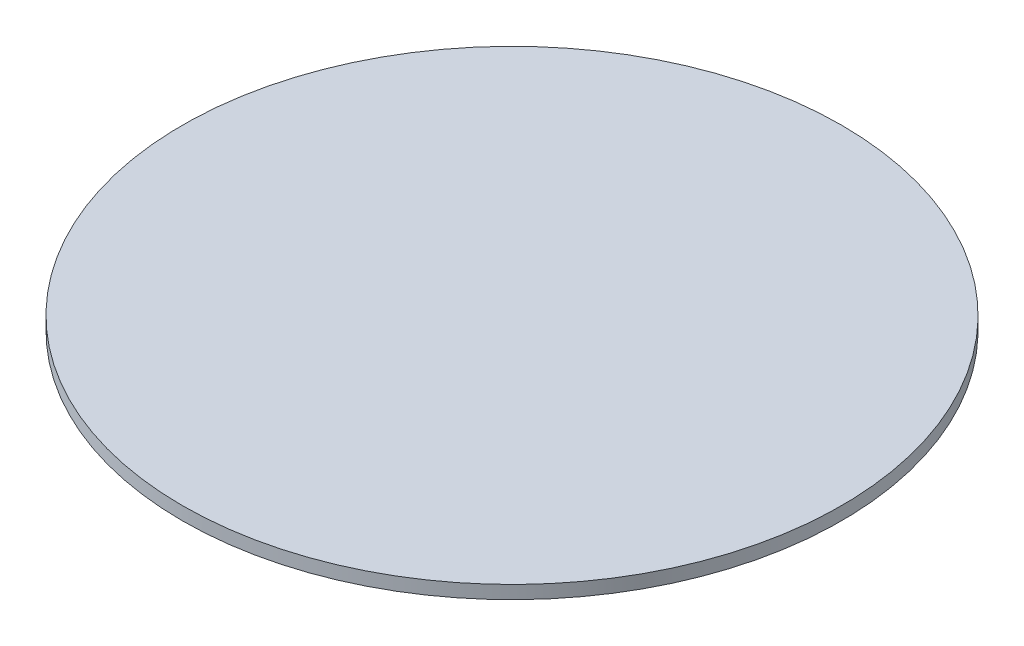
from build123d import *

# Parameters (mm, degrees)
SKETCH3_R           = 63.5
BOSS_EXTRUDE1_DEPTH = 2.54


with BuildPart() as part:
    # Sketch3 → Boss-Extrude1 (new body)
    with BuildSketch(Plane(origin=(0, 0, 0), x_dir=(1, 0, 0), z_dir=(0, 1, 0))):
        with Locations(Location((0, 0, 0), (0, 0, 270))):
            Circle(SKETCH3_R)
    extrude(amount=BOSS_EXTRUDE1_DEPTH)


solid = part.part
